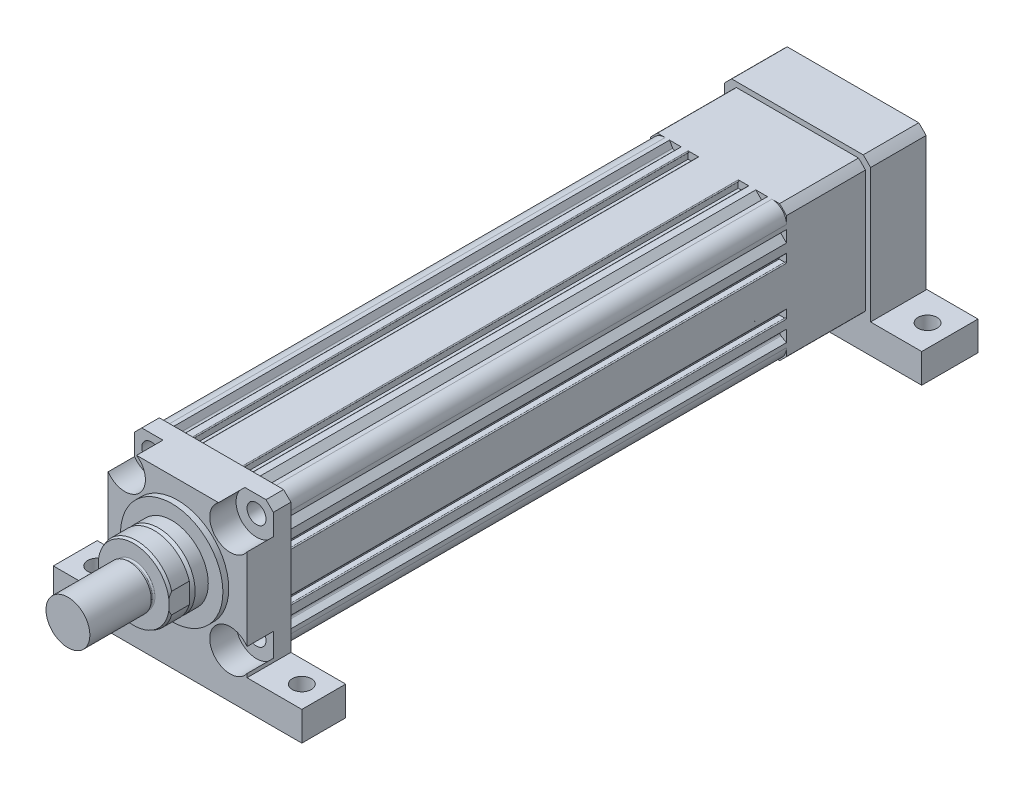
from build123d import *
from OCP.BRepFilletAPI import BRepFilletAPI_MakeChamfer

# Parameters (mm, degrees)
SKETCH_1_R          = 40
SKETCH_1_R_2        = 4.35
EXTRUDE_1_DEPTH     = 340
EXTRUDE_1_2_DEPTH   = 30
SKETCH_3_R          = 35
EXTRUDE_2_DEPTH     = 4
SKETCH_3_3_R        = 6.5
CUT_EXTRUDE_1_DEPTH = 30
SKETCH_3_4_R        = 6.5
CUT_EXTRUDE_2_DEPTH = 17
SKETCH_4_R          = 25
EXTRUDE_3_DEPTH     = 12
CHAMFER_1_SIZE      = 3
CHAMFER_1_SIZE2     = 1.732050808
EXTRUDE_4_DEPTH     = 14
CHAMFER_2_SIZE      = 2
CHAMFER_2_SIZE2     = 0.727940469
SKETCH_6_R          = 13.5
EXTRUDE_5_DEPTH     = 3
SKETCH_7_R          = 15
EXTRUDE_6_DEPTH     = 42
FILLET_1_R          = 1
EXTRUDE_7_DEPTH     = 54
EXTRUDE_8_DEPTH     = 38
SKETCH_10_R         = 40
CUT_EXTRUDE_3_DEPTH = 18.5
SKETCH_11_R         = 32
CUT_EXTRUDE_4_DEPTH = 15
SKETCH_12_W         = 170
SKETCH_12_H         = 38.5
SKETCH_12_R         = 6.5
SKETCH_12_H_2       = 30
EXTRUDE_9_DEPTH     = 20
SKETCH_14_W         = 95
SKETCH_14_H         = 95
EXTRUDE_10_DEPTH    = 30
CUT_EXTRUDE_6_DEPTH = 18
SKETCH_16_R         = 6.5
CUT_EXTRUDE_7_DEPTH = 30
CHAMFER_3_SIZE      = 5


with BuildPart() as part:
    # Sketch 1 → Extrude 1 (new body)
    with BuildSketch(Plane.XY):
        with BuildLine():
            Line((46.5, -36.5), (46.5, -33.5))
            Line((46.5, -33.5), (42.782554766, -31.353731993))
            ThreePointArc((42.782554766, -31.353731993), (42.192820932, -30.47113294), (42.534026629, -29.465973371))
            Line((42.534026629, -29.465973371), (46.5, -25.5))
            Line((46.5, -25.5), (46.5, -19.6))
            ThreePointArc((46.5, -19.6), (46.353553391, -19.246446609), (46, -19.1))
            ThreePointArc((46, -19.1), (45.646446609, -19.246446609), (45.5, -19.6))
            Line((45.5, -19.6), (41.5, -19.6))
            Line((41.5, -19.6), (41.5, -13.5))
            Line((41.5, -13.5), (45.5, -13.5))
            ThreePointArc((45.5, -13.5), (45.646446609, -13.853553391), (46, -14))
            ThreePointArc((46, -14), (46.353553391, -13.853553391), (46.5, -13.5))
            Line((46.5, -13.5), (46.5, 13.5))
            ThreePointArc((46.5, 13.5), (46.353553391, 13.853553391), (46, 14))
            ThreePointArc((46, 14), (45.646446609, 13.853553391), (45.5, 13.5))
            Line((45.5, 13.5), (41.5, 13.5))
            Line((41.5, 13.5), (41.5, 19.6))
            Line((41.5, 19.6), (45.5, 19.6))
            ThreePointArc((45.5, 19.6), (45.646446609, 19.246446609), (46, 19.1))
            ThreePointArc((46, 19.1), (46.353553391, 19.246446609), (46.5, 19.6))
            Line((46.5, 19.6), (46.5, 25.5))
            Line((46.5, 25.5), (42.534026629, 29.465973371))
            ThreePointArc((42.534026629, 29.465973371), (42.192820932, 30.47113294), (42.782554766, 31.353731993))
            Line((42.782554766, 31.353731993), (46.5, 33.5))
            Line((46.5, 33.5), (46.5, 36.5))
            ThreePointArc((46.5, 36.5), (43.571067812, 43.571067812), (36.5, 46.5))
            Line((36.5, 46.5), (33.5, 46.5))
            Line((33.5, 46.5), (31.353731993, 42.782554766))
            ThreePointArc((31.353731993, 42.782554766), (30.47113294, 42.192820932), (29.465973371, 42.534026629))
            Line((29.465973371, 42.534026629), (25.5, 46.5))
            Line((25.5, 46.5), (20.8, 46.5))
            ThreePointArc((20.8, 46.5), (20.446446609, 46.353553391), (20.3, 46))
            ThreePointArc((20.3, 46), (20.446446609, 45.646446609), (20.8, 45.5))
            Line((20.8, 45.5), (20.8, 41.5))
            Line((20.8, 41.5), (13.5, 41.5))
            Line((13.5, 41.5), (13.5, 45.5))
            ThreePointArc((13.5, 45.5), (13.853553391, 45.646446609), (14, 46))
            ThreePointArc((14, 46), (13.853553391, 46.353553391), (13.5, 46.5))
            Line((13.5, 46.5), (-13.5, 46.5))
            ThreePointArc((-13.5, 46.5), (-13.853553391, 46.353553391), (-14, 46))
            ThreePointArc((-14, 46), (-13.853553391, 45.646446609), (-13.5, 45.5))
            Line((-13.5, 45.5), (-13.5, 41.5))
            Line((-13.5, 41.5), (-20.8, 41.5))
            Line((-20.8, 41.5), (-20.8, 45.5))
            ThreePointArc((-20.8, 45.5), (-20.446446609, 45.646446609), (-20.3, 46))
            ThreePointArc((-20.3, 46), (-20.446446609, 46.353553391), (-20.8, 46.5))
            Line((-20.8, 46.5), (-25.5, 46.5))
            Line((-25.5, 46.5), (-29.465973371, 42.534026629))
            ThreePointArc((-29.465973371, 42.534026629), (-30.47113294, 42.192820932), (-31.353731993, 42.782554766))
            Line((-31.353731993, 42.782554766), (-33.5, 46.5))
            Line((-33.5, 46.5), (-36.5, 46.5))
            ThreePointArc((-36.5, 46.5), (-43.571067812, 43.571067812), (-46.5, 36.5))
            Line((-46.5, 36.5), (-46.5, 33.5))
            Line((-46.5, 33.5), (-42.782554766, 31.353731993))
            ThreePointArc((-42.782554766, 31.353731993), (-42.192820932, 30.47113294), (-42.534026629, 29.465973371))
            Line((-42.534026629, 29.465973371), (-46.5, 25.5))
            Line((-46.5, 25.5), (-46.5, 20))
            ThreePointArc((-46.5, 20), (-46.353553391, 19.646446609), (-46, 19.5))
            ThreePointArc((-46, 19.5), (-45.646446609, 19.646446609), (-45.5, 20))
            Line((-45.5, 20), (-41.5, 20))
            Line((-41.5, 20), (-41.5, 13.9))
            Line((-41.5, 13.9), (-45.5, 13.9))
            ThreePointArc((-45.5, 13.9), (-45.646446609, 14.253553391), (-46, 14.4))
            ThreePointArc((-46, 14.4), (-46.353553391, 14.253553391), (-46.5, 13.9))
            Line((-46.5, 13.9), (-46.5, -13.9))
            ThreePointArc((-46.5, -13.9), (-46.353553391, -14.253553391), (-46, -14.4))
            ThreePointArc((-46, -14.4), (-45.646446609, -14.253553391), (-45.5, -13.9))
            Line((-45.5, -13.9), (-41.5, -13.9))
            Line((-41.5, -13.9), (-41.5, -20))
            Line((-41.5, -20), (-45.5, -20))
            ThreePointArc((-45.5, -20), (-45.646446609, -19.646446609), (-46, -19.5))
            ThreePointArc((-46, -19.5), (-46.353553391, -19.646446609), (-46.5, -20))
            Line((-46.5, -20), (-46.5, -25.5))
            Line((-46.5, -25.5), (-42.534026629, -29.465973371))
            ThreePointArc((-42.534026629, -29.465973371), (-42.192820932, -30.47113294), (-42.782554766, -31.353731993))
            Line((-42.782554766, -31.353731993), (-46.5, -33.5))
            Line((-46.5, -33.5), (-46.5, -36.5))
            ThreePointArc((-46.5, -36.5), (-43.571067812, -43.571067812), (-36.5, -46.5))
            Line((-36.5, -46.5), (-33.5, -46.5))
            Line((-33.5, -46.5), (-31.353731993, -42.782554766))
            ThreePointArc((-31.353731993, -42.782554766), (-30.47113294, -42.192820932), (-29.465973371, -42.534026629))
            Line((-29.465973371, -42.534026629), (-25.5, -46.5))
            Line((-25.5, -46.5), (25.5, -46.5))
            Line((25.5, -46.5), (29.465973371, -42.534026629))
            ThreePointArc((29.465973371, -42.534026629), (30.47113294, -42.192820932), (31.353731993, -42.782554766))
            Line((31.353731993, -42.782554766), (33.5, -46.5))
            Line((33.5, -46.5), (36.5, -46.5))
            ThreePointArc((36.5, -46.5), (43.571067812, -43.571067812), (46.5, -36.5))
        make_face()
        Circle(SKETCH_1_R, mode=Mode.SUBTRACT)
        with Locations((36, -36)):
            Circle(SKETCH_1_R_2, mode=Mode.SUBTRACT)
        with Locations((-36, -36)):
            Circle(SKETCH_1_R_2, mode=Mode.SUBTRACT)
        with Locations((36, 36)):
            Circle(SKETCH_1_R_2, mode=Mode.SUBTRACT)
        with Locations((-36, 36)):
            Circle(SKETCH_1_R_2, mode=Mode.SUBTRACT)
        with BuildLine():
            Line((25.75, -42.5), (11.324751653, -42.5))
            ThreePointArc((11.324751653, -42.5), (10.829080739, -42.065653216), (11.194582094, -41.517241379))
            ThreePointArc((11.194582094, -41.517241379), (18.919894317, -38.613956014), (25.948275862, -34.288292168))
            ThreePointArc((25.948275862, -34.288292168), (26.472640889, -34.239297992), (26.75, -34.68699324))
            Line((26.75, -34.68699324), (26.75, -41.5))
            Line((26.75, -41.5), (25.75, -42.5))
        make_face(mode=Mode.SUBTRACT)
        with BuildLine():
            Line((-25.75, -42.5), (-11.324751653, -42.5))
            ThreePointArc((-11.324751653, -42.5), (-10.829080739, -42.065653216), (-11.194582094, -41.517241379))
            ThreePointArc((-11.194582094, -41.517241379), (-18.919894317, -38.613956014), (-25.948275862, -34.288292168))
            ThreePointArc((-25.948275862, -34.288292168), (-26.472640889, -34.239297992), (-26.75, -34.68699324))
            Line((-26.75, -34.68699324), (-26.75, -41.5))
            Line((-26.75, -41.5), (-25.75, -42.5))
        make_face(mode=Mode.SUBTRACT)
        with BuildLine():
            Line((26.312283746, 40), (20.798294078, 40))
            ThreePointArc((20.798294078, 40), (20.548294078, 39.933012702), (20.365281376, 39.75))
            Line((20.365281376, 39.75), (19.794336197, 38.761093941))
            ThreePointArc((19.794336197, 38.761093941), (19.747068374, 38.372059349), (19.994850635, 38.068437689))
            ThreePointArc((19.994850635, 38.068437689), (22.57372353, 36.598183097), (25.045011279, 34.953503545))
            ThreePointArc((25.045011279, 34.953503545), (25.441798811, 34.871210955), (25.769245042, 35.109939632))
            Line((25.769245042, 35.109939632), (27.64187192, 38.353424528))
            ThreePointArc((27.64187192, 38.353424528), (27.704581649, 38.668687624), (27.562412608, 38.956977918))
            Line((27.562412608, 38.956977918), (26.665837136, 39.853553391))
            ThreePointArc((26.665837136, 39.853553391), (26.503625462, 39.961939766), (26.312283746, 40))
        make_face(mode=Mode.SUBTRACT)
        with BuildLine():
            Line((38.956977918, 27.562412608), (39.853553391, 26.665837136))
            ThreePointArc((39.853553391, 26.665837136), (39.961939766, 26.503625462), (40, 26.312283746))
            Line((40, 26.312283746), (40, 20.798294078))
            ThreePointArc((40, 20.798294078), (39.933012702, 20.548294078), (39.75, 20.365281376))
            Line((39.75, 20.365281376), (38.761093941, 19.794336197))
            ThreePointArc((38.761093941, 19.794336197), (38.372059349, 19.747068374), (38.068437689, 19.994850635))
            ThreePointArc((38.068437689, 19.994850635), (36.598183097, 22.57372353), (34.953503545, 25.045011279))
            ThreePointArc((34.953503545, 25.045011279), (34.871210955, 25.441798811), (35.109939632, 25.769245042))
            Line((35.109939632, 25.769245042), (38.353424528, 27.64187192))
            ThreePointArc((38.353424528, 27.64187192), (38.668687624, 27.704581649), (38.956977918, 27.562412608))
        make_face(mode=Mode.SUBTRACT)
        with BuildLine():
            Line((38.956977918, -27.562412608), (39.853553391, -26.665837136))
            ThreePointArc((39.853553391, -26.665837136), (39.961939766, -26.503625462), (40, -26.312283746))
            Line((40, -26.312283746), (40, -20.798294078))
            ThreePointArc((40, -20.798294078), (39.933012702, -20.548294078), (39.75, -20.365281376))
            Line((39.75, -20.365281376), (38.761093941, -19.794336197))
            ThreePointArc((38.761093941, -19.794336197), (38.372059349, -19.747068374), (38.068437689, -19.994850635))
            ThreePointArc((38.068437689, -19.994850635), (36.598183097, -22.57372353), (34.953503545, -25.045011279))
            ThreePointArc((34.953503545, -25.045011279), (34.871210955, -25.441798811), (35.109939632, -25.769245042))
            Line((35.109939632, -25.769245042), (38.353424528, -27.64187192))
            ThreePointArc((38.353424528, -27.64187192), (38.668687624, -27.704581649), (38.956977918, -27.562412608))
        make_face(mode=Mode.SUBTRACT)
        with BuildLine():
            Line((-39.75, -20.365281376), (-38.761093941, -19.794336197))
            ThreePointArc((-38.761093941, -19.794336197), (-38.372059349, -19.747068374), (-38.068437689, -19.994850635))
            ThreePointArc((-38.068437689, -19.994850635), (-36.598183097, -22.57372353), (-34.953503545, -25.045011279))
            ThreePointArc((-34.953503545, -25.045011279), (-34.871210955, -25.441798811), (-35.109939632, -25.769245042))
            Line((-35.109939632, -25.769245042), (-38.353424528, -27.64187192))
            ThreePointArc((-38.353424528, -27.64187192), (-38.668687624, -27.704581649), (-38.956977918, -27.562412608))
            Line((-38.956977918, -27.562412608), (-39.853553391, -26.665837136))
            ThreePointArc((-39.853553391, -26.665837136), (-39.961939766, -26.503625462), (-40, -26.312283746))
            Line((-40, -26.312283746), (-40, -20.798294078))
            ThreePointArc((-40, -20.798294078), (-39.933012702, -20.548294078), (-39.75, -20.365281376))
        make_face(mode=Mode.SUBTRACT)
        with BuildLine():
            Line((-20.365281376, 39.75), (-19.794336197, 38.761093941))
            ThreePointArc((-19.794336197, 38.761093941), (-19.747068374, 38.372059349), (-19.994850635, 38.068437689))
            ThreePointArc((-19.994850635, 38.068437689), (-22.57372353, 36.598183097), (-25.045011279, 34.953503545))
            ThreePointArc((-25.045011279, 34.953503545), (-25.441798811, 34.871210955), (-25.769245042, 35.109939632))
            Line((-25.769245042, 35.109939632), (-27.64187192, 38.353424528))
            ThreePointArc((-27.64187192, 38.353424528), (-27.704581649, 38.668687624), (-27.562412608, 38.956977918))
            Line((-27.562412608, 38.956977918), (-26.665837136, 39.853553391))
            ThreePointArc((-26.665837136, 39.853553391), (-26.503625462, 39.961939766), (-26.312283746, 40))
            Line((-26.312283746, 40), (-20.798294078, 40))
            ThreePointArc((-20.798294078, 40), (-20.548294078, 39.933012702), (-20.365281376, 39.75))
        make_face(mode=Mode.SUBTRACT)
        with BuildLine():
            Line((-38.956977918, 27.562412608), (-39.853553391, 26.665837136))
            ThreePointArc((-39.853553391, 26.665837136), (-39.961939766, 26.503625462), (-40, 26.312283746))
            Line((-40, 26.312283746), (-40, 20.798294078))
            ThreePointArc((-40, 20.798294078), (-39.933012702, 20.548294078), (-39.75, 20.365281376))
            Line((-39.75, 20.365281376), (-38.761093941, 19.794336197))
            ThreePointArc((-38.761093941, 19.794336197), (-38.372059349, 19.747068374), (-38.068437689, 19.994850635))
            ThreePointArc((-38.068437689, 19.994850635), (-36.598183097, 22.57372353), (-34.953503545, 25.045011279))
            ThreePointArc((-34.953503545, 25.045011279), (-34.871210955, 25.441798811), (-35.109939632, 25.769245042))
            Line((-35.109939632, 25.769245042), (-38.353424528, 27.64187192))
            ThreePointArc((-38.353424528, 27.64187192), (-38.668687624, 27.704581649), (-38.956977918, 27.562412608))
        make_face(mode=Mode.SUBTRACT)
    extrude(amount=EXTRUDE_1_DEPTH)

    # Sketch 2 → Extrude 1 2 (add)
    with BuildSketch(Plane.XY.offset(340)):
        Polygon((-47.5, 45.5), (-45.5, 47.5), (45.5, 47.5), (47.5, 45.5), (47.5, -45.5), (47.5, -47.5), (45.5, -47.5), (-45.5, -47.5), (-47.5, -47.5), (-47.5, -45.5), align=None)
    extrude(amount=EXTRUDE_1_2_DEPTH)

    # Sketch 3 → Extrude 2 (add)
    with BuildSketch(Plane.XY.offset(370)):
        Circle(SKETCH_3_R)
    extrude(amount=EXTRUDE_2_DEPTH)

    # Sketch 3_3 → Cut-Extrude 1 (cut)
    with BuildSketch(Plane.XY.offset(370)):
        with Locations((-36, 36)):
            Circle(SKETCH_3_3_R)
        with Locations((36, 36)):
            Circle(SKETCH_3_3_R)
        with Locations((60, 32.5)):
            Circle(SKETCH_3_3_R)
        with Locations((36, -36)):
            Circle(SKETCH_3_3_R)
        with Locations((-36, -36)):
            Circle(SKETCH_3_3_R)
        with Locations((-60, -32.5)):
            Circle(SKETCH_3_3_R)
        with Locations((-60, 32.5)):
            Circle(SKETCH_3_3_R)
    extrude(amount=-CUT_EXTRUDE_1_DEPTH, mode=Mode.SUBTRACT)

    # Sketch 3_4 → Cut-Extrude 2 (cut)
    # profile 1 of 4: a face of its own
    with BuildSketch(Plane.XY.offset(370)):
        with BuildLine():
            Line((-47.5, 45.5), (-47.5, 28.015640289))
            ThreePointArc((-47.5, 28.015640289), (-31.816699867, 22.639610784), (-22, 36))
            Line((-22, 36), (-22, 47.5))
            Line((-22, 47.5), (-45.5, 47.5))
            Line((-45.5, 47.5), (-47.5, 45.5))
        make_face()
        with Locations((-36, 36)):
            Circle(SKETCH_3_4_R, mode=Mode.SUBTRACT)
    # profile 2 of 4: a face of its own
    with BuildSketch(Plane.XY.offset(370)):
        with BuildLine():
            ThreePointArc((-22, -36), (-31.816699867, -22.639610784), (-47.5, -28.015640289))
            Line((-47.5, -28.015640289), (-47.5, -47.5))
            Line((-47.5, -47.5), (-22, -47.5))
            Line((-22, -47.5), (-22, -36))
        make_face()
        with Locations((-36, -36)):
            Circle(SKETCH_3_4_R, mode=Mode.SUBTRACT)
    # profile 3 of 4: a face of its own
    with BuildSketch(Plane.XY.offset(370)):
        with BuildLine():
            Line((45.5, 47.5), (22, 47.5))
            Line((22, 47.5), (22, 36))
            ThreePointArc((22, 36), (31.816699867, 22.639610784), (47.5, 28.015640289))
            Line((47.5, 28.015640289), (47.5, 45.5))
            Line((47.5, 45.5), (45.5, 47.5))
        make_face()
        with Locations((36, 36)):
            Circle(SKETCH_3_4_R, mode=Mode.SUBTRACT)
    # profile 4 of 4: a face of its own
    with BuildSketch(Plane.XY.offset(370)):
        with BuildLine():
            Line((22, -36), (22, -47.5))
            Line((22, -47.5), (47.5, -47.5))
            Line((47.5, -47.5), (47.5, -28.015640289))
            ThreePointArc((47.5, -28.015640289), (31.816699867, -22.639610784), (22, -36))
        make_face()
        with Locations((36, -36)):
            Circle(SKETCH_3_4_R, mode=Mode.SUBTRACT)
    extrude(amount=-CUT_EXTRUDE_2_DEPTH, mode=Mode.SUBTRACT)

    # Sketch 4 → Extrude 3 (add)
    with BuildSketch(Plane.XY.offset(374)):
        Circle(SKETCH_4_R)
    extrude(amount=EXTRUDE_3_DEPTH)

    # Chamfer 1
    chamfer_1_edges = [part.edges().sort_by_distance(p)[0] for p in [
        (-25, 0, 386),
    ]]
    chamfer_1_side = [part.faces().sort_by_distance(p)[0] for p in [
        (-25, 0, 380),
    ]]
    chamfer(chamfer_1_edges, length=CHAMFER_1_SIZE, length2=CHAMFER_1_SIZE2, reference=chamfer_1_side[0])

    # Sketch 5 → Extrude 4 (add)
    with BuildSketch(Plane.XY.offset(386)):
        with BuildLine():
            Line((-24, 7), (-24, -7))
            ThreePointArc((-24, -7), (0, -25), (24, -7))
            Line((24, -7), (24, 7))
            ThreePointArc((24, 7), (0, 25), (-24, 7))
        make_face()
    extrude(amount=EXTRUDE_4_DEPTH)

    # Chamfer 2: one chamfer whose edges measure the first distance from different faces: ONE call of the kernel's chamfer builder (chamfer() names one face for all edges)
    chamfer_2_edges_1 = [part.edges().sort_by_distance(p)[0] for p in [
        (0, 25, 400),
    ]]
    chamfer_2_side_1 = [part.faces().sort_by_distance(p)[0] for p in [
        (0, 25, 393),
    ]]
    chamfer_2_edges_2 = [part.edges().sort_by_distance(p)[0] for p in [
        (0, -25, 400),
    ]]
    chamfer_2_side_2 = [part.faces().sort_by_distance(p)[0] for p in [
        (0, -25, 393),
    ]]
    chamfer_2 = BRepFilletAPI_MakeChamfer(part.part.solid().wrapped)
    for e in chamfer_2_edges_1:
        chamfer_2.Add(CHAMFER_2_SIZE, CHAMFER_2_SIZE2, e.wrapped, chamfer_2_side_1[0].wrapped)  # the first distance lies on this face
    for e in chamfer_2_edges_2:
        chamfer_2.Add(CHAMFER_2_SIZE, CHAMFER_2_SIZE2, e.wrapped, chamfer_2_side_2[0].wrapped)  # the first distance lies on this face
    add(Compound.cast(chamfer_2.Shape()), mode=Mode.REPLACE)

    # Sketch 6 → Extrude 5 (add)
    with BuildSketch(Plane.XY.offset(400)):
        Circle(SKETCH_6_R)
    extrude(amount=EXTRUDE_5_DEPTH)

    # Sketch 7 → Extrude 6 (add)
    with BuildSketch(Plane.XY.offset(403)):
        with Locations(Location((0, 0, 0), (0, 0, 180))):
            Circle(SKETCH_7_R)
    extrude(amount=EXTRUDE_6_DEPTH)

    # Fillet 1
    fillet_1_edges = [part.edges().sort_by_distance(p)[0] for p in [
        (-13.5, 0, 400),
    ]]
    fillet(fillet_1_edges, radius=FILLET_1_R)



with BuildPart() as body_2:
    # Sketch 8 → Extrude 7 (new body)
    with BuildSketch(Plane(origin=(0, 0, 0), x_dir=(-1, 0, 0), z_dir=(0, 0, -1))):
        with BuildLine():
            Line((-41.761226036, 46.5), (41.761226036, 46.5))
            ThreePointArc((41.761226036, 46.5), (44.194173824, 44.194173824), (46.5, 41.761226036))
            Line((46.5, 41.761226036), (46.5, -41.761226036))
            ThreePointArc((46.5, -41.761226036), (44.194173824, -44.194173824), (41.761226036, -46.5))
            Line((41.761226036, -46.5), (-41.761226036, -46.5))
            ThreePointArc((-41.761226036, -46.5), (-44.194173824, -44.194173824), (-46.5, -41.761226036))
            Line((-46.5, -41.761226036), (-46.5, 41.761226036))
            ThreePointArc((-46.5, 41.761226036), (-44.194173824, 44.194173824), (-41.761226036, 46.5))
        make_face()
    extrude(amount=EXTRUDE_7_DEPTH)

    # Sketch 9 → Extrude 8 (add)
    with BuildSketch(Plane(origin=(0, 0, -54), x_dir=(-1, 0, 0), z_dir=(0, 0, -1))):
        with BuildLine():
            Line((50, -44.972908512), (50, -50))
            Line((50, -50), (44.972908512, -50))
            Line((44.972908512, -50), (-44.972908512, -50))
            Line((-44.972908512, -50), (-50, -50))
            Line((-50, -50), (-50, -44.972908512))
            Line((-50, -44.972908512), (-50, 44.972908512))
            ThreePointArc((-50, 44.972908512), (-47.552931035, 47.552931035), (-44.972908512, 50))
            Line((-44.972908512, 50), (44.972908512, 50))
            ThreePointArc((44.972908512, 50), (47.552931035, 47.552931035), (50, 44.972908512))
            Line((50, 44.972908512), (50, -44.972908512))
        make_face()
    extrude(amount=EXTRUDE_8_DEPTH)

    # Sketch 10 → Cut-Extrude 3 (cut)
    with BuildSketch(Plane(origin=(0, 0, -92), x_dir=(-1, 0, 0), z_dir=(0, 0, -1))):
        Circle(SKETCH_10_R)
    extrude(amount=-CUT_EXTRUDE_3_DEPTH, mode=Mode.SUBTRACT)

    # Sketch 11 → Cut-Extrude 4 (cut)
    with BuildSketch(Plane(origin=(0, 0, -73.5), x_dir=(-1, 0, 0), z_dir=(0, 0, -1))):
        Circle(SKETCH_11_R)
    extrude(amount=-CUT_EXTRUDE_4_DEPTH, mode=Mode.SUBTRACT)


with BuildPart() as part_1:
    add(part.part)

    add(body_2.part)  # Extrude 9 merges body 2
    # Sketch 12 → Extrude 9 (add)
    # profile 1 of 2: a face of its own
    with BuildSketch(Plane.XZ.offset(46.5)):
        with Locations((0, -73.25)):
            Rectangle(SKETCH_12_W, SKETCH_12_H)
        with Locations(Location((-70, -73, 0), (0, 0, 270))):
            Circle(SKETCH_12_R, mode=Mode.SUBTRACT)
        with Locations(Location((70, -73, 0), (0, 0, 270))):
            Circle(SKETCH_12_R, mode=Mode.SUBTRACT)
    # profile 2 of 2: a face of its own
    with BuildSketch(Plane.XZ.offset(46.5)):
        with Locations((0, 355)):
            Rectangle(SKETCH_12_W, SKETCH_12_H_2)
        with Locations(Location((-70, 355, 0), (0, 0, 270))):
            Circle(SKETCH_12_R, mode=Mode.SUBTRACT)
        with Locations(Location((70, 355, 0), (0, 0, 270))):
            Circle(SKETCH_12_R, mode=Mode.SUBTRACT)
    extrude(amount=EXTRUDE_9_DEPTH)

    # Sketch 14 → Extrude 10 (add)
    with BuildSketch(Plane.XY.offset(370)):
        Rectangle(SKETCH_14_W, SKETCH_14_H)
    extrude(amount=-EXTRUDE_10_DEPTH)

    # Sketch 15 → Cut-Extrude 6 (cut)
    with BuildSketch(Plane.XY.offset(370)):
        with BuildLine():
            ThreePointArc((-36, 22), (-26.100505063, 26.100505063), (-22, 36))
            ThreePointArc((-22, 36), (-23.594738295, 42.489181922), (-28.015640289, 47.5))
            Line((-28.015640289, 47.5), (-43.984359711, 47.5))
            ThreePointArc((-43.984359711, 47.5), (-45.899494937, 45.899494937), (-47.5, 43.984359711))
            Line((-47.5, 43.984359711), (-47.5, 28.015640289))
            ThreePointArc((-47.5, 28.015640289), (-42.489181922, 23.594738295), (-36, 22))
        make_face()
        with BuildLine():
            ThreePointArc((-47.5, 43.984359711), (-45.899494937, 45.899494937), (-43.984359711, 47.5))
            Line((-43.984359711, 47.5), (-47.5, 47.5))
            Line((-47.5, 47.5), (-47.5, 43.984359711))
        make_face()
        with BuildLine():
            ThreePointArc((28.015640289, 47.5), (23.594738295, 42.489181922), (22, 36))
            ThreePointArc((22, 36), (26.100505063, 26.100505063), (36, 22))
            ThreePointArc((36, 22), (42.489181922, 23.594738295), (47.5, 28.015640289))
            Line((47.5, 28.015640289), (47.5, 43.984359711))
            ThreePointArc((47.5, 43.984359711), (45.899494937, 45.899494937), (43.984359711, 47.5))
            Line((43.984359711, 47.5), (28.015640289, 47.5))
        make_face()
        with BuildLine():
            Line((47.5, 47.5), (43.984359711, 47.5))
            ThreePointArc((43.984359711, 47.5), (45.899494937, 45.899494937), (47.5, 43.984359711))
            Line((47.5, 43.984359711), (47.5, 47.5))
        make_face()
        with BuildLine():
            ThreePointArc((50, -36), (49.360389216, -31.816699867), (47.5, -28.015640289))
            Line((47.5, -28.015640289), (47.5, -43.984359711))
            ThreePointArc((47.5, -43.984359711), (49.360389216, -40.183300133), (50, -36))
        make_face()
        with BuildLine():
            Line((47.5, -43.984359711), (47.5, -28.015640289))
            ThreePointArc((47.5, -28.015640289), (22, -36), (47.5, -43.984359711))
        make_face()
        with BuildLine():
            ThreePointArc((-22, -36), (-31.816699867, -22.639610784), (-47.5, -28.015640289))
            Line((-47.5, -28.015640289), (-47.5, -43.984359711))
            ThreePointArc((-47.5, -43.984359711), (-31.816699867, -49.360389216), (-22, -36))
        make_face()
        with BuildLine():
            Line((-47.5, -43.984359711), (-47.5, -28.015640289))
            ThreePointArc((-47.5, -28.015640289), (-50, -36), (-47.5, -43.984359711))
        make_face()
        with BuildLine():
            ThreePointArc((-47.5, 43.984359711), (-50, 36), (-47.5, 28.015640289))
            Line((-47.5, 28.015640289), (-47.5, 43.984359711))
        make_face()
        with BuildLine():
            Line((-43.984359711, 47.5), (-28.015640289, 47.5))
            ThreePointArc((-28.015640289, 47.5), (-31.816699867, 49.360389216), (-36, 50))
            ThreePointArc((-36, 50), (-40.183300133, 49.360389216), (-43.984359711, 47.5))
        make_face()
        with BuildLine():
            Line((47.5, 43.984359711), (47.5, 28.015640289))
            ThreePointArc((47.5, 28.015640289), (49.360389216, 31.816699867), (50, 36))
            ThreePointArc((50, 36), (49.360389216, 40.183300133), (47.5, 43.984359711))
        make_face()
        with BuildLine():
            ThreePointArc((-36, 22), (-26.100505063, 26.100505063), (-22, 36))
            ThreePointArc((-22, 36), (-23.594738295, 42.489181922), (-28.015640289, 47.5))
            Line((-28.015640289, 47.5), (-43.984359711, 47.5))
            ThreePointArc((-43.984359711, 47.5), (-45.899494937, 45.899494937), (-47.5, 43.984359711))
            Line((-47.5, 43.984359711), (-47.5, 28.015640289))
            ThreePointArc((-47.5, 28.015640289), (-42.489181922, 23.594738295), (-36, 22))
        make_face()
        with BuildLine():
            ThreePointArc((-47.5, 43.984359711), (-45.899494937, 45.899494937), (-43.984359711, 47.5))
            Line((-43.984359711, 47.5), (-47.5, 47.5))
            Line((-47.5, 47.5), (-47.5, 43.984359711))
        make_face()
        with BuildLine():
            ThreePointArc((28.015640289, 47.5), (23.594738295, 42.489181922), (22, 36))
            ThreePointArc((22, 36), (26.100505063, 26.100505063), (36, 22))
            ThreePointArc((36, 22), (42.489181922, 23.594738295), (47.5, 28.015640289))
            Line((47.5, 28.015640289), (47.5, 43.984359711))
            ThreePointArc((47.5, 43.984359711), (45.899494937, 45.899494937), (43.984359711, 47.5))
            Line((43.984359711, 47.5), (28.015640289, 47.5))
        make_face()
        with BuildLine():
            Line((47.5, 47.5), (43.984359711, 47.5))
            ThreePointArc((43.984359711, 47.5), (45.899494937, 45.899494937), (47.5, 43.984359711))
            Line((47.5, 43.984359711), (47.5, 47.5))
        make_face()
    extrude(amount=-CUT_EXTRUDE_6_DEPTH, mode=Mode.SUBTRACT)

    # Sketch 16 → Cut-Extrude 7 (cut)
    with BuildSketch(Plane.XY.offset(352)):
        with Locations((-36, 36)):
            Circle(SKETCH_16_R)
        with Locations((36, 36)):
            Circle(SKETCH_16_R)
        with Locations((36, -36)):
            Circle(SKETCH_16_R)
        with Locations((-36, -36)):
            Circle(SKETCH_16_R)
    extrude(amount=-CUT_EXTRUDE_7_DEPTH, mode=Mode.SUBTRACT)

    # Chamfer 3
    chamfer_3_edges = [part_1.edges().sort_by_distance(p)[0] for p in [
        (-47.5, 47.5, 346),
        (47.5, 47.5, 346),
    ]]
    chamfer(chamfer_3_edges, length=CHAMFER_3_SIZE)


solid = part_1.part
